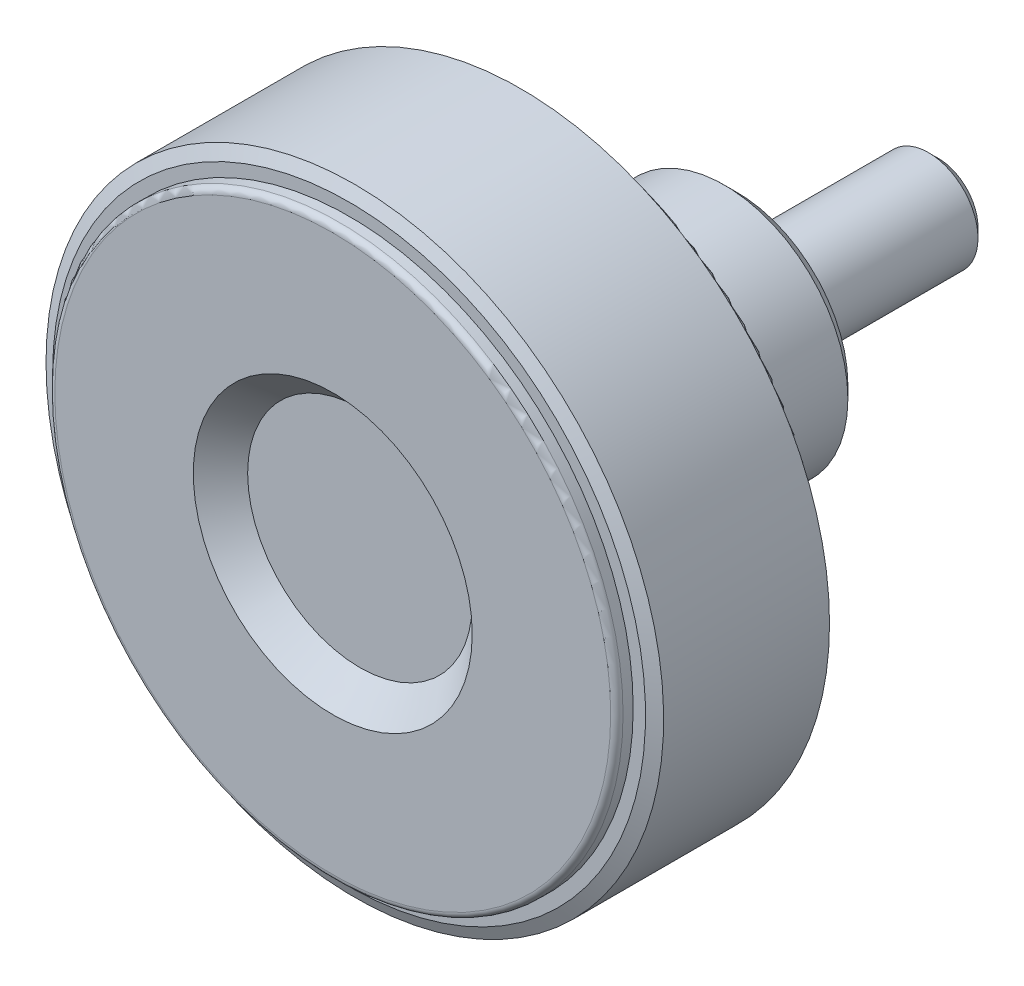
ISO-10303-21;
HEADER;
FILE_DESCRIPTION(('STEP AP214'),'2;1');
FILE_NAME('part.step','',(''),(''),'','','');
FILE_SCHEMA(('AUTOMOTIVE_DESIGN { 1 0 10303 214 1 1 1 1 }'));
ENDSEC;
DATA;
#1=APPLICATION_CONTEXT('core data for automotive mechanical design processes');
#2=APPLICATION_PROTOCOL_DEFINITION('international standard','automotive_design',2000,#1);
#3=PRODUCT_CONTEXT('',#1,'mechanical');
#4=PRODUCT('Part','Part','',(#3));
#5=PRODUCT_RELATED_PRODUCT_CATEGORY('part','',(#4));
#6=PRODUCT_DEFINITION_FORMATION('','',#4);
#7=PRODUCT_DEFINITION_CONTEXT('part definition',#1,'design');
#8=PRODUCT_DEFINITION('design','',#6,#7);
#9=PRODUCT_DEFINITION_SHAPE('','',#8);
#10=(LENGTH_UNIT() NAMED_UNIT(*) SI_UNIT(.MILLI.,.METRE.));
#11=(NAMED_UNIT(*) PLANE_ANGLE_UNIT() SI_UNIT($,.RADIAN.));
#12=(NAMED_UNIT(*) SI_UNIT($,.STERADIAN.) SOLID_ANGLE_UNIT());
#13=UNCERTAINTY_MEASURE_WITH_UNIT(LENGTH_MEASURE(1.E-05),#10,'distance_accuracy_value','');
#14=(GEOMETRIC_REPRESENTATION_CONTEXT(3) GLOBAL_UNCERTAINTY_ASSIGNED_CONTEXT((#13)) GLOBAL_UNIT_ASSIGNED_CONTEXT((#10,
#11,#12)) REPRESENTATION_CONTEXT('',''));
#15=CARTESIAN_POINT('',(0.,0.,0.));
#16=DIRECTION('',(0.,0.,1.));
#17=DIRECTION('',(1.,0.,0.));
#18=AXIS2_PLACEMENT_3D('',#15,#16,#17);
#19=CARTESIAN_POINT('',(0.,1.6165,-16.));
#20=DIRECTION('',(0.,0.,-1.));
#21=DIRECTION('',(-1.,0.,0.));
#22=AXIS2_PLACEMENT_3D('',#19,#20,#21);
#23=PLANE('',#22);
#24=CARTESIAN_POINT('',(0.,0.,-16.0000000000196));
#25=DIRECTION('',(0.,0.,1.));
#26=DIRECTION('',(1.,0.,0.));
#27=AXIS2_PLACEMENT_3D('',#24,#25,#26);
#28=CIRCLE('',#27,3.23299999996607);
#29=CARTESIAN_POINT('',(3.23299999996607,0.,-16.0000000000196));
#30=VERTEX_POINT('',#29);
#31=EDGE_CURVE('E179',#30,#30,#28,.T.);
#32=ORIENTED_EDGE('',*,*,#31,.F.);
#33=EDGE_LOOP('',(#32));
#34=FACE_BOUND('',#33,.T.);
#35=ADVANCED_FACE('F14',(#34),#23,.T.);
#36=CARTESIAN_POINT('',(0.,0.,-15.2329999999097));
#37=DIRECTION('',(0.,0.,1.));
#38=DIRECTION('',(1.,0.,0.));
#39=AXIS2_PLACEMENT_3D('',#36,#37,#38);
#40=CONICAL_SURFACE('',#39,4.00000000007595,0.785398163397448);
#41=ORIENTED_EDGE('',*,*,#31,.T.);
#42=EDGE_LOOP('',(#41));
#43=FACE_BOUND('',#42,.T.);
#44=CARTESIAN_POINT('',(0.,0.,-15.233));
#45=DIRECTION('',(0.,0.,1.));
#46=DIRECTION('',(1.,0.,0.));
#47=AXIS2_PLACEMENT_3D('',#44,#45,#46);
#48=CIRCLE('',#47,4.);
#49=CARTESIAN_POINT('',(4.,0.,-15.233));
#50=VERTEX_POINT('',#49);
#51=EDGE_CURVE('E176',#50,#50,#48,.T.);
#52=ORIENTED_EDGE('',*,*,#51,.F.);
#53=EDGE_LOOP('',(#52));
#54=FACE_BOUND('',#53,.T.);
#55=ADVANCED_FACE('F536',(#43,#54),#40,.T.);
#56=CARTESIAN_POINT('',(0.,0.,-7.1165));
#57=DIRECTION('',(0.,0.,1.));
#58=DIRECTION('',(1.,0.,0.));
#59=AXIS2_PLACEMENT_3D('',#56,#57,#58);
#60=CYLINDRICAL_SURFACE('',#59,4.);
#61=ORIENTED_EDGE('',*,*,#51,.T.);
#62=EDGE_LOOP('',(#61));
#63=FACE_BOUND('',#62,.T.);
#64=CARTESIAN_POINT('',(0.,0.,0.));
#65=DIRECTION('',(0.,0.,1.));
#66=DIRECTION('',(1.,0.,0.));
#67=AXIS2_PLACEMENT_3D('',#64,#65,#66);
#68=CIRCLE('',#67,4.);
#69=CARTESIAN_POINT('',(4.,0.,0.));
#70=VERTEX_POINT('',#69);
#71=EDGE_CURVE('E178',#70,#70,#68,.T.);
#72=ORIENTED_EDGE('',*,*,#71,.F.);
#73=EDGE_LOOP('',(#72));
#74=FACE_BOUND('',#73,.T.);
#75=ADVANCED_FACE('F526',(#63,#74),#60,.T.);
#76=CARTESIAN_POINT('',(0.,2.66666666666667,0.));
#77=DIRECTION('',(0.,0.,-1.));
#78=DIRECTION('',(-1.,0.,0.));
#79=AXIS2_PLACEMENT_3D('',#76,#77,#78);
#80=PLANE('',#79);
#81=CARTESIAN_POINT('',(0.,0.,0.));
#82=DIRECTION('',(0.,0.,1.));
#83=DIRECTION('',(1.,0.,0.));
#84=AXIS2_PLACEMENT_3D('',#81,#82,#83);
#85=CIRCLE('',#84,5.33333333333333);
#86=CARTESIAN_POINT('',(5.33333333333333,0.,0.));
#87=VERTEX_POINT('',#86);
#88=EDGE_CURVE('E211',#87,#87,#85,.T.);
#89=ORIENTED_EDGE('',*,*,#88,.F.);
#90=EDGE_LOOP('',(#89));
#91=FACE_BOUND('',#90,.T.);
#92=ORIENTED_EDGE('',*,*,#71,.T.);
#93=EDGE_LOOP('',(#92));
#94=FACE_BOUND('',#93,.T.);
#95=ADVANCED_FACE('F516',(#91,#94),#80,.T.);
#96=CARTESIAN_POINT('',(0.,0.,0.15));
#97=DIRECTION('',(0.,0.,1.));
#98=DIRECTION('',(1.,0.,0.));
#99=AXIS2_PLACEMENT_3D('',#96,#97,#98);
#100=CYLINDRICAL_SURFACE('',#99,5.33333333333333);
#101=ORIENTED_EDGE('',*,*,#88,.T.);
#102=EDGE_LOOP('',(#101));
#103=FACE_BOUND('',#102,.T.);
#104=CARTESIAN_POINT('',(0.,0.,0.3));
#105=DIRECTION('',(0.,0.,1.));
#106=DIRECTION('',(1.,0.,0.));
#107=AXIS2_PLACEMENT_3D('',#104,#105,#106);
#108=CIRCLE('',#107,5.33333333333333);
#109=CARTESIAN_POINT('',(5.33333333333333,0.,0.3));
#110=VERTEX_POINT('',#109);
#111=EDGE_CURVE('E208',#110,#110,#108,.T.);
#112=ORIENTED_EDGE('',*,*,#111,.F.);
#113=EDGE_LOOP('',(#112));
#114=FACE_BOUND('',#113,.T.);
#115=ADVANCED_FACE('F506',(#103,#114),#100,.T.);
#116=CARTESIAN_POINT('',(0.,7.16666666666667,0.3));
#117=DIRECTION('',(0.,0.,-1.));
#118=DIRECTION('',(-1.,0.,0.));
#119=AXIS2_PLACEMENT_3D('',#116,#117,#118);
#120=PLANE('',#119);
#121=CARTESIAN_POINT('',(0.,0.,0.3));
#122=DIRECTION('',(0.,0.,1.));
#123=DIRECTION('',(1.,0.,0.));
#124=AXIS2_PLACEMENT_3D('',#121,#122,#123);
#125=CIRCLE('',#124,9.);
#126=CARTESIAN_POINT('',(9.,0.,0.3));
#127=VERTEX_POINT('',#126);
#128=EDGE_CURVE('E175',#127,#127,#125,.T.);
#129=ORIENTED_EDGE('',*,*,#128,.F.);
#130=EDGE_LOOP('',(#129));
#131=FACE_BOUND('',#130,.T.);
#132=ORIENTED_EDGE('',*,*,#111,.T.);
#133=EDGE_LOOP('',(#132));
#134=FACE_BOUND('',#133,.T.);
#135=ADVANCED_FACE('F496',(#131,#134),#120,.T.);
#136=CARTESIAN_POINT('',(0.,0.,1.3));
#137=DIRECTION('',(0.,0.,1.));
#138=DIRECTION('',(1.,0.,0.));
#139=AXIS2_PLACEMENT_3D('',#136,#137,#138);
#140=CONICAL_SURFACE('',#139,10.,0.785398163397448);
#141=ORIENTED_EDGE('',*,*,#128,.T.);
#142=EDGE_LOOP('',(#141));
#143=FACE_BOUND('',#142,.T.);
#144=CARTESIAN_POINT('',(0.,0.,1.3));
#145=DIRECTION('',(0.,0.,1.));
#146=DIRECTION('',(1.,0.,0.));
#147=AXIS2_PLACEMENT_3D('',#144,#145,#146);
#148=CIRCLE('',#147,10.);
#149=CARTESIAN_POINT('',(10.,0.,1.3));
#150=VERTEX_POINT('',#149);
#151=EDGE_CURVE('E172',#150,#150,#148,.T.);
#152=ORIENTED_EDGE('',*,*,#151,.F.);
#153=EDGE_LOOP('',(#152));
#154=FACE_BOUND('',#153,.T.);
#155=ADVANCED_FACE('F487',(#143,#154),#140,.T.);
#156=CARTESIAN_POINT('',(0.,0.,13.9));
#157=DIRECTION('',(0.,0.,1.));
#158=DIRECTION('',(1.,0.,0.));
#159=AXIS2_PLACEMENT_3D('',#156,#157,#158);
#160=CYLINDRICAL_SURFACE('',#159,10.);
#161=ORIENTED_EDGE('',*,*,#151,.T.);
#162=EDGE_LOOP('',(#161));
#163=FACE_BOUND('',#162,.T.);
#164=CARTESIAN_POINT('',(0.,0.,26.5));
#165=DIRECTION('',(0.,0.,-1.));
#166=DIRECTION('',(-1.,0.,0.));
#167=AXIS2_PLACEMENT_3D('',#164,#165,#166);
#168=CIRCLE('',#167,10.);
#169=CARTESIAN_POINT('',(-10.,0.,26.5));
#170=VERTEX_POINT('',#169);
#171=EDGE_CURVE('E75',#170,#170,#168,.T.);
#172=ORIENTED_EDGE('',*,*,#171,.T.);
#173=EDGE_LOOP('',(#172));
#174=FACE_BOUND('',#173,.T.);
#175=ADVANCED_FACE('F482',(#163,#174),#160,.T.);
#176=CARTESIAN_POINT('',(0.,0.,26.5));
#177=DIRECTION('',(0.,0.,-1.));
#178=DIRECTION('',(-1.,0.,0.));
#179=AXIS2_PLACEMENT_3D('',#176,#177,#178);
#180=TOROIDAL_SURFACE('',#179,11.,1.);
#181=CARTESIAN_POINT('',(0.,0.,27.5));
#182=DIRECTION('',(0.,0.,-1.));
#183=DIRECTION('',(1.,0.,0.));
#184=AXIS2_PLACEMENT_3D('',#181,#182,#183);
#185=CIRCLE('',#184,11.);
#186=CARTESIAN_POINT('',(-11.,0.,27.5));
#187=VERTEX_POINT('',#186);
#188=CARTESIAN_POINT('',(11.,0.,27.5));
#189=VERTEX_POINT('',#188);
#190=EDGE_CURVE('E68',#187,#189,#185,.F.);
#191=ORIENTED_EDGE('',*,*,#190,.F.);
#192=CARTESIAN_POINT('',(0.,0.,27.5));
#193=DIRECTION('',(0.,0.,-1.));
#194=DIRECTION('',(-1.,0.,0.));
#195=AXIS2_PLACEMENT_3D('',#192,#193,#194);
#196=CIRCLE('',#195,11.);
#197=CARTESIAN_POINT('',(0.,11.,27.5));
#198=VERTEX_POINT('',#197);
#199=EDGE_CURVE('E71',#198,#187,#196,.F.);
#200=ORIENTED_EDGE('',*,*,#199,.F.);
#201=CARTESIAN_POINT('',(0.,0.,27.5));
#202=DIRECTION('',(0.,0.,-1.));
#203=DIRECTION('',(0.,1.,0.));
#204=AXIS2_PLACEMENT_3D('',#201,#202,#203);
#205=CIRCLE('',#204,11.);
#206=EDGE_CURVE('E63',#189,#198,#205,.F.);
#207=ORIENTED_EDGE('',*,*,#206,.F.);
#208=EDGE_LOOP('',(#191,#200,#207));
#209=FACE_BOUND('',#208,.T.);
#210=ORIENTED_EDGE('',*,*,#171,.F.);
#211=EDGE_LOOP('',(#210));
#212=FACE_BOUND('',#211,.T.);
#213=ADVANCED_FACE('F66',(#209,#212),#180,.F.);
#214=CARTESIAN_POINT('',(0.,14.6153846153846,27.5));
#215=DIRECTION('',(0.,0.,-1.));
#216=DIRECTION('',(-1.,0.,0.));
#217=AXIS2_PLACEMENT_3D('',#214,#215,#216);
#218=PLANE('',#217);
#219=CARTESIAN_POINT('',(0.,0.,27.5));
#220=DIRECTION('',(0.,0.,1.));
#221=DIRECTION('',(-1.,0.,0.));
#222=AXIS2_PLACEMENT_3D('',#219,#220,#221);
#223=CIRCLE('',#222,18.2307692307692);
#224=CARTESIAN_POINT('',(18.2307692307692,0.,27.5));
#225=VERTEX_POINT('',#224);
#226=CARTESIAN_POINT('',(-18.2307692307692,0.,27.5));
#227=VERTEX_POINT('',#226);
#228=EDGE_CURVE('E81',#225,#227,#223,.F.);
#229=ORIENTED_EDGE('',*,*,#228,.T.);
#230=CARTESIAN_POINT('',(0.,0.,27.5));
#231=DIRECTION('',(0.,0.,1.));
#232=DIRECTION('',(0.,1.,0.));
#233=AXIS2_PLACEMENT_3D('',#230,#231,#232);
#234=CIRCLE('',#233,18.2307692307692);
#235=CARTESIAN_POINT('',(0.,18.2307692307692,27.5));
#236=VERTEX_POINT('',#235);
#237=EDGE_CURVE('E130',#227,#236,#234,.F.);
#238=ORIENTED_EDGE('',*,*,#237,.T.);
#239=CARTESIAN_POINT('',(0.,0.,27.5));
#240=DIRECTION('',(0.,0.,1.));
#241=DIRECTION('',(1.,0.,0.));
#242=AXIS2_PLACEMENT_3D('',#239,#240,#241);
#243=CIRCLE('',#242,18.2307692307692);
#244=EDGE_CURVE('E143',#236,#225,#243,.F.);
#245=ORIENTED_EDGE('',*,*,#244,.T.);
#246=EDGE_LOOP('',(#229,#238,#245));
#247=FACE_BOUND('',#246,.T.);
#248=ORIENTED_EDGE('',*,*,#199,.T.);
#249=ORIENTED_EDGE('',*,*,#190,.T.);
#250=ORIENTED_EDGE('',*,*,#206,.T.);
#251=EDGE_LOOP('',(#248,#249,#250));
#252=FACE_BOUND('',#251,.T.);
#253=ADVANCED_FACE('F79',(#247,#252),#218,.T.);
#254=CARTESIAN_POINT('',(0.,0.,26.5));
#255=DIRECTION('',(0.,0.,-1.));
#256=DIRECTION('',(-1.,0.,0.));
#257=AXIS2_PLACEMENT_3D('',#254,#255,#256);
#258=TOROIDAL_SURFACE('',#257,18.2307692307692,1.);
#259=ORIENTED_EDGE('',*,*,#237,.F.);
#260=ORIENTED_EDGE('',*,*,#228,.F.);
#261=ORIENTED_EDGE('',*,*,#244,.F.);
#262=EDGE_LOOP('',(#259,#260,#261));
#263=FACE_BOUND('',#262,.T.);
#264=CARTESIAN_POINT('',(0.,0.,26.5));
#265=DIRECTION('',(0.,0.,1.));
#266=DIRECTION('',(1.,0.,0.));
#267=AXIS2_PLACEMENT_3D('',#264,#265,#266);
#268=CIRCLE('',#267,19.2307692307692);
#269=CARTESIAN_POINT('',(19.2307692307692,0.,26.5));
#270=VERTEX_POINT('',#269);
#271=EDGE_CURVE('E205',#270,#270,#268,.F.);
#272=ORIENTED_EDGE('',*,*,#271,.T.);
#273=EDGE_LOOP('',(#272));
#274=FACE_BOUND('',#273,.T.);
#275=ADVANCED_FACE('F100',(#263,#274),#258,.F.);
#276=CARTESIAN_POINT('',(0.,0.,21.25));
#277=DIRECTION('',(0.,0.,1.));
#278=DIRECTION('',(1.,0.,0.));
#279=AXIS2_PLACEMENT_3D('',#276,#277,#278);
#280=CYLINDRICAL_SURFACE('',#279,19.2307692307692);
#281=ORIENTED_EDGE('',*,*,#271,.F.);
#282=EDGE_LOOP('',(#281));
#283=FACE_BOUND('',#282,.T.);
#284=CARTESIAN_POINT('',(0.,0.,16.));
#285=DIRECTION('',(0.,0.,1.));
#286=DIRECTION('',(1.,0.,0.));
#287=AXIS2_PLACEMENT_3D('',#284,#285,#286);
#288=CIRCLE('',#287,19.2307692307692);
#289=CARTESIAN_POINT('',(19.2307692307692,0.,16.));
#290=VERTEX_POINT('',#289);
#291=EDGE_CURVE('E201',#290,#290,#288,.T.);
#292=ORIENTED_EDGE('',*,*,#291,.F.);
#293=EDGE_LOOP('',(#292));
#294=FACE_BOUND('',#293,.T.);
#295=ADVANCED_FACE('F329',(#283,#294),#280,.F.);
#296=CARTESIAN_POINT('',(0.,20.8653846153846,16.));
#297=DIRECTION('',(0.,0.,-1.));
#298=DIRECTION('',(-1.,0.,0.));
#299=AXIS2_PLACEMENT_3D('',#296,#297,#298);
#300=PLANE('',#299);
#301=CARTESIAN_POINT('',(0.,0.,16.));
#302=DIRECTION('',(0.,0.,1.));
#303=DIRECTION('',(-1.,0.,0.));
#304=AXIS2_PLACEMENT_3D('',#301,#302,#303);
#305=CIRCLE('',#304,22.5);
#306=CARTESIAN_POINT('',(-22.5,0.,16.));
#307=VERTEX_POINT('',#306);
#308=CARTESIAN_POINT('',(22.5,0.,16.));
#309=VERTEX_POINT('',#308);
#310=EDGE_CURVE('E264',#307,#309,#305,.T.);
#311=ORIENTED_EDGE('',*,*,#310,.F.);
#312=CARTESIAN_POINT('',(0.,0.,16.));
#313=DIRECTION('',(0.,0.,1.));
#314=DIRECTION('',(0.,1.,0.));
#315=AXIS2_PLACEMENT_3D('',#312,#313,#314);
#316=CIRCLE('',#315,22.5);
#317=CARTESIAN_POINT('',(0.,22.5,16.));
#318=VERTEX_POINT('',#317);
#319=EDGE_CURVE('E299',#318,#307,#316,.T.);
#320=ORIENTED_EDGE('',*,*,#319,.F.);
#321=CARTESIAN_POINT('',(0.,0.,16.));
#322=DIRECTION('',(0.,0.,1.));
#323=DIRECTION('',(1.,0.,0.));
#324=AXIS2_PLACEMENT_3D('',#321,#322,#323);
#325=CIRCLE('',#324,22.5);
#326=EDGE_CURVE('E204',#309,#318,#325,.T.);
#327=ORIENTED_EDGE('',*,*,#326,.F.);
#328=EDGE_LOOP('',(#311,#320,#327));
#329=FACE_BOUND('',#328,.T.);
#330=ORIENTED_EDGE('',*,*,#291,.T.);
#331=EDGE_LOOP('',(#330));
#332=FACE_BOUND('',#331,.T.);
#333=ADVANCED_FACE('F275',(#329,#332),#300,.T.);
#334=CARTESIAN_POINT('',(0.,0.,16.5));
#335=DIRECTION('',(0.,0.,-1.));
#336=DIRECTION('',(-1.,0.,0.));
#337=AXIS2_PLACEMENT_3D('',#334,#335,#336);
#338=TOROIDAL_SURFACE('',#337,22.5,0.5);
#339=ORIENTED_EDGE('',*,*,#319,.T.);
#340=ORIENTED_EDGE('',*,*,#310,.T.);
#341=ORIENTED_EDGE('',*,*,#326,.T.);
#342=EDGE_LOOP('',(#339,#340,#341));
#343=FACE_BOUND('',#342,.T.);
#344=CARTESIAN_POINT('',(0.,0.,16.5));
#345=DIRECTION('',(0.,0.,1.));
#346=DIRECTION('',(1.,0.,0.));
#347=AXIS2_PLACEMENT_3D('',#344,#345,#346);
#348=CIRCLE('',#347,23.);
#349=CARTESIAN_POINT('',(23.,0.,16.5));
#350=VERTEX_POINT('',#349);
#351=EDGE_CURVE('E200',#350,#350,#348,.T.);
#352=ORIENTED_EDGE('',*,*,#351,.F.);
#353=EDGE_LOOP('',(#352));
#354=FACE_BOUND('',#353,.T.);
#355=ADVANCED_FACE('F269',(#343,#354),#338,.T.);
#356=CARTESIAN_POINT('',(0.,0.,16.91));
#357=DIRECTION('',(0.,0.,1.));
#358=DIRECTION('',(1.,0.,0.));
#359=AXIS2_PLACEMENT_3D('',#356,#357,#358);
#360=CYLINDRICAL_SURFACE('',#359,23.);
#361=ORIENTED_EDGE('',*,*,#351,.T.);
#362=EDGE_LOOP('',(#361));
#363=FACE_BOUND('',#362,.T.);
#364=CARTESIAN_POINT('',(0.,0.,17.32));
#365=DIRECTION('',(0.,0.,1.));
#366=DIRECTION('',(1.,0.,0.));
#367=AXIS2_PLACEMENT_3D('',#364,#365,#366);
#368=CIRCLE('',#367,23.);
#369=CARTESIAN_POINT('',(23.,0.,17.32));
#370=VERTEX_POINT('',#369);
#371=EDGE_CURVE('E197',#370,#370,#368,.T.);
#372=ORIENTED_EDGE('',*,*,#371,.F.);
#373=EDGE_LOOP('',(#372));
#374=FACE_BOUND('',#373,.T.);
#375=ADVANCED_FACE('F274',(#363,#374),#360,.T.);
#376=CARTESIAN_POINT('',(0.,23.5,17.32));
#377=DIRECTION('',(0.,0.,-1.));
#378=DIRECTION('',(-1.,0.,0.));
#379=AXIS2_PLACEMENT_3D('',#376,#377,#378);
#380=PLANE('',#379);
#381=CARTESIAN_POINT('',(0.,0.,17.32));
#382=DIRECTION('',(0.,0.,1.));
#383=DIRECTION('',(1.,0.,0.));
#384=AXIS2_PLACEMENT_3D('',#381,#382,#383);
#385=CIRCLE('',#384,24.);
#386=CARTESIAN_POINT('',(24.,0.,17.32));
#387=VERTEX_POINT('',#386);
#388=EDGE_CURVE('E193',#387,#387,#385,.T.);
#389=ORIENTED_EDGE('',*,*,#388,.F.);
#390=EDGE_LOOP('',(#389));
#391=FACE_BOUND('',#390,.T.);
#392=ORIENTED_EDGE('',*,*,#371,.T.);
#393=EDGE_LOOP('',(#392));
#394=FACE_BOUND('',#393,.T.);
#395=ADVANCED_FACE('F342',(#391,#394),#380,.T.);
#396=CARTESIAN_POINT('',(0.,0.,17.786307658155));
#397=DIRECTION('',(0.,0.,1.));
#398=DIRECTION('',(1.,0.,0.));
#399=AXIS2_PLACEMENT_3D('',#396,#397,#398);
#400=CONICAL_SURFACE('',#399,25.,1.13446401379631);
#401=CARTESIAN_POINT('',(4.86721773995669E-13,1.73372427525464E-12,17.786307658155));
#402=DIRECTION('',(0.,0.,-1.));
#403=DIRECTION('',(-1.,0.,0.));
#404=AXIS2_PLACEMENT_3D('',#401,#402,#403);
#405=CIRCLE('',#404,24.9999999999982);
#406=CARTESIAN_POINT('',(-24.9999999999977,1.73372427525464E-12,17.786307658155));
#407=VERTEX_POINT('',#406);
#408=EDGE_CURVE('E196',#407,#407,#405,.F.);
#409=ORIENTED_EDGE('',*,*,#408,.F.);
#410=EDGE_LOOP('',(#409));
#411=FACE_BOUND('',#410,.T.);
#412=ORIENTED_EDGE('',*,*,#388,.T.);
#413=EDGE_LOOP('',(#412));
#414=FACE_BOUND('',#413,.T.);
#415=ADVANCED_FACE('F340',(#411,#414),#400,.T.);
#416=CARTESIAN_POINT('',(0.,4.54545454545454,30.8));
#417=DIRECTION('',(0.,0.,1.));
#418=DIRECTION('',(1.,0.,0.));
#419=AXIS2_PLACEMENT_3D('',#416,#417,#418);
#420=PLANE('',#419);
#421=CARTESIAN_POINT('',(0.,0.,30.8));
#422=DIRECTION('',(0.,0.,1.));
#423=DIRECTION('',(1.,0.,0.));
#424=AXIS2_PLACEMENT_3D('',#421,#422,#423);
#425=CIRCLE('',#424,9.0909090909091);
#426=CARTESIAN_POINT('',(9.0909090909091,0.,30.8));
#427=VERTEX_POINT('',#426);
#428=EDGE_CURVE('E181',#427,#427,#425,.T.);
#429=ORIENTED_EDGE('',*,*,#428,.T.);
#430=EDGE_LOOP('',(#429));
#431=FACE_BOUND('',#430,.T.);
#432=ADVANCED_FACE('F242',(#431),#420,.T.);
#433=CARTESIAN_POINT('',(0.,0.,33.));
#434=DIRECTION('',(0.,0.,1.));
#435=DIRECTION('',(1.,0.,0.));
#436=AXIS2_PLACEMENT_3D('',#433,#434,#435);
#437=CONICAL_SURFACE('',#436,11.2909090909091,0.785398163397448);
#438=CARTESIAN_POINT('',(0.,0.,33.));
#439=DIRECTION('',(0.,0.,1.));
#440=DIRECTION('',(1.,0.,0.));
#441=AXIS2_PLACEMENT_3D('',#438,#439,#440);
#442=CIRCLE('',#441,11.2909090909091);
#443=CARTESIAN_POINT('',(11.2909090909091,0.,33.));
#444=VERTEX_POINT('',#443);
#445=EDGE_CURVE('E9',#444,#444,#442,.F.);
#446=ORIENTED_EDGE('',*,*,#445,.F.);
#447=EDGE_LOOP('',(#446));
#448=FACE_BOUND('',#447,.T.);
#449=ORIENTED_EDGE('',*,*,#428,.F.);
#450=EDGE_LOOP('',(#449));
#451=FACE_BOUND('',#450,.T.);
#452=ADVANCED_FACE('F240',(#448,#451),#437,.F.);
#453=CARTESIAN_POINT('',(0.,16.8954545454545,33.));
#454=DIRECTION('',(0.,0.,1.));
#455=DIRECTION('',(1.,0.,0.));
#456=AXIS2_PLACEMENT_3D('',#453,#454,#455);
#457=PLANE('',#456);
#458=ORIENTED_EDGE('',*,*,#445,.T.);
#459=EDGE_LOOP('',(#458));
#460=FACE_BOUND('',#459,.T.);
#461=CARTESIAN_POINT('',(0.,0.,33.));
#462=DIRECTION('',(0.,0.,-1.));
#463=DIRECTION('',(-1.,0.,0.));
#464=AXIS2_PLACEMENT_3D('',#461,#462,#463);
#465=CIRCLE('',#464,22.5);
#466=CARTESIAN_POINT('',(0.,22.5,33.));
#467=VERTEX_POINT('',#466);
#468=CARTESIAN_POINT('',(-22.5,0.,33.));
#469=VERTEX_POINT('',#468);
#470=EDGE_CURVE('E219',#467,#469,#465,.F.);
#471=ORIENTED_EDGE('',*,*,#470,.T.);
#472=CARTESIAN_POINT('',(0.,0.,33.));
#473=DIRECTION('',(0.,0.,-1.));
#474=DIRECTION('',(1.,0.,0.));
#475=AXIS2_PLACEMENT_3D('',#472,#473,#474);
#476=CIRCLE('',#475,22.5);
#477=CARTESIAN_POINT('',(22.5,0.,33.));
#478=VERTEX_POINT('',#477);
#479=EDGE_CURVE('E23',#469,#478,#476,.F.);
#480=ORIENTED_EDGE('',*,*,#479,.T.);
#481=CARTESIAN_POINT('',(0.,0.,33.));
#482=DIRECTION('',(0.,0.,-1.));
#483=DIRECTION('',(0.,1.,0.));
#484=AXIS2_PLACEMENT_3D('',#481,#482,#483);
#485=CIRCLE('',#484,22.5);
#486=EDGE_CURVE('E184',#478,#467,#485,.F.);
#487=ORIENTED_EDGE('',*,*,#486,.T.);
#488=EDGE_LOOP('',(#471,#480,#487));
#489=FACE_BOUND('',#488,.T.);
#490=ADVANCED_FACE('F238',(#460,#489),#457,.T.);
#491=CARTESIAN_POINT('',(0.,0.,32.5));
#492=DIRECTION('',(0.,0.,-1.));
#493=DIRECTION('',(-1.,0.,0.));
#494=AXIS2_PLACEMENT_3D('',#491,#492,#493);
#495=TOROIDAL_SURFACE('',#494,22.5,0.5);
#496=CARTESIAN_POINT('',(0.,0.,32.5));
#497=DIRECTION('',(0.,0.,-1.));
#498=DIRECTION('',(-1.,0.,0.));
#499=AXIS2_PLACEMENT_3D('',#496,#497,#498);
#500=CIRCLE('',#499,23.);
#501=CARTESIAN_POINT('',(-23.,0.,32.5));
#502=VERTEX_POINT('',#501);
#503=EDGE_CURVE('E185',#502,#502,#500,.F.);
#504=ORIENTED_EDGE('',*,*,#503,.T.);
#505=EDGE_LOOP('',(#504));
#506=FACE_BOUND('',#505,.T.);
#507=ORIENTED_EDGE('',*,*,#479,.F.);
#508=ORIENTED_EDGE('',*,*,#470,.F.);
#509=ORIENTED_EDGE('',*,*,#486,.F.);
#510=EDGE_LOOP('',(#507,#508,#509));
#511=FACE_BOUND('',#510,.T.);
#512=ADVANCED_FACE('F226',(#506,#511),#495,.T.);
#513=CARTESIAN_POINT('',(0.,0.,32.09));
#514=DIRECTION('',(0.,0.,1.));
#515=DIRECTION('',(1.,0.,0.));
#516=AXIS2_PLACEMENT_3D('',#513,#514,#515);
#517=CYLINDRICAL_SURFACE('',#516,23.);
#518=ORIENTED_EDGE('',*,*,#503,.F.);
#519=EDGE_LOOP('',(#518));
#520=FACE_BOUND('',#519,.T.);
#521=CARTESIAN_POINT('',(0.,0.,31.68));
#522=DIRECTION('',(0.,0.,1.));
#523=DIRECTION('',(1.,0.,0.));
#524=AXIS2_PLACEMENT_3D('',#521,#522,#523);
#525=CIRCLE('',#524,23.);
#526=CARTESIAN_POINT('',(23.,0.,31.68));
#527=VERTEX_POINT('',#526);
#528=EDGE_CURVE('E186',#527,#527,#525,.T.);
#529=ORIENTED_EDGE('',*,*,#528,.T.);
#530=EDGE_LOOP('',(#529));
#531=FACE_BOUND('',#530,.T.);
#532=ADVANCED_FACE('F237',(#520,#531),#517,.T.);
#533=CARTESIAN_POINT('',(0.,0.,31.213692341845));
#534=DIRECTION('',(0.,0.,-1.));
#535=DIRECTION('',(-1.,0.,0.));
#536=AXIS2_PLACEMENT_3D('',#533,#534,#535);
#537=CONICAL_SURFACE('',#536,25.,1.13446401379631);
#538=CARTESIAN_POINT('',(0.,0.,31.68));
#539=DIRECTION('',(0.,0.,-1.));
#540=DIRECTION('',(-1.,0.,0.));
#541=AXIS2_PLACEMENT_3D('',#538,#539,#540);
#542=CIRCLE('',#541,24.);
#543=CARTESIAN_POINT('',(-24.,0.,31.68));
#544=VERTEX_POINT('',#543);
#545=EDGE_CURVE('E189',#544,#544,#542,.F.);
#546=ORIENTED_EDGE('',*,*,#545,.F.);
#547=EDGE_LOOP('',(#546));
#548=FACE_BOUND('',#547,.T.);
#549=CARTESIAN_POINT('',(0.,0.,31.213692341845));
#550=DIRECTION('',(0.,0.,-1.));
#551=DIRECTION('',(0.,1.,0.));
#552=AXIS2_PLACEMENT_3D('',#549,#550,#551);
#553=CIRCLE('',#552,25.);
#554=CARTESIAN_POINT('',(0.,25.,31.213692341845));
#555=VERTEX_POINT('',#554);
#556=EDGE_CURVE('E192',#555,#555,#553,.F.);
#557=ORIENTED_EDGE('',*,*,#556,.T.);
#558=EDGE_LOOP('',(#557));
#559=FACE_BOUND('',#558,.T.);
#560=ADVANCED_FACE('F360',(#548,#559),#537,.T.);
#561=CARTESIAN_POINT('',(0.,23.5,31.68));
#562=DIRECTION('',(0.,0.,1.));
#563=DIRECTION('',(1.,0.,0.));
#564=AXIS2_PLACEMENT_3D('',#561,#562,#563);
#565=PLANE('',#564);
#566=ORIENTED_EDGE('',*,*,#528,.F.);
#567=EDGE_LOOP('',(#566));
#568=FACE_BOUND('',#567,.T.);
#569=ORIENTED_EDGE('',*,*,#545,.T.);
#570=EDGE_LOOP('',(#569));
#571=FACE_BOUND('',#570,.T.);
#572=ADVANCED_FACE('F358',(#568,#571),#565,.T.);
#573=CARTESIAN_POINT('',(4.86721773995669E-13,1.73372427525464E-12,0.));
#574=DIRECTION('',(0.,0.,-1.));
#575=DIRECTION('',(-1.,0.,0.));
#576=AXIS2_PLACEMENT_3D('',#573,#574,#575);
#577=CYLINDRICAL_SURFACE('',#576,24.9999999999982);
#578=ORIENTED_EDGE('',*,*,#408,.T.);
#579=EDGE_LOOP('',(#578));
#580=FACE_BOUND('',#579,.T.);
#581=ORIENTED_EDGE('',*,*,#556,.F.);
#582=EDGE_LOOP('',(#581));
#583=FACE_BOUND('',#582,.T.);
#584=ADVANCED_FACE('F355',(#580,#583),#577,.T.);
#585=CLOSED_SHELL('',(#35,#55,#75,#95,#115,#135,#155,#175,#213,#253,#275,#295,#333,#355,#375,
#395,#415,#432,#452,#490,#512,#532,#560,#572,#584));
#586=MANIFOLD_SOLID_BREP('B1',#585);
#587=ADVANCED_BREP_SHAPE_REPRESENTATION('',(#18,#586),#14);
#588=SHAPE_DEFINITION_REPRESENTATION(#9,#587);
ENDSEC;
END-ISO-10303-21;
